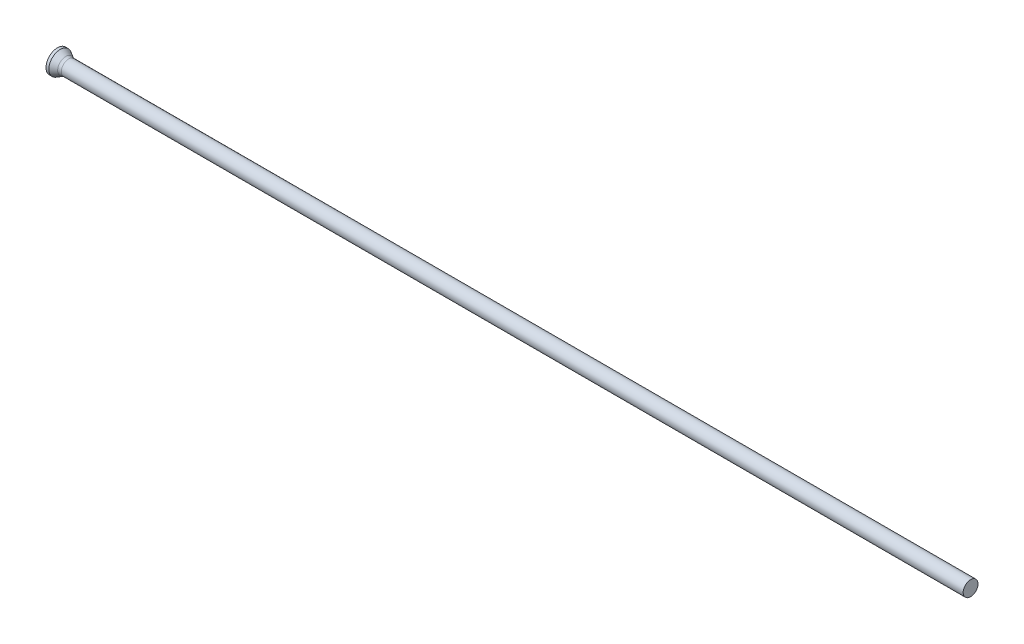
ISO-10303-21;
HEADER;
FILE_DESCRIPTION(('STEP AP214'),'2;1');
FILE_NAME('part.step','',(''),(''),'','','');
FILE_SCHEMA(('AUTOMOTIVE_DESIGN { 1 0 10303 214 1 1 1 1 }'));
ENDSEC;
DATA;
#1=APPLICATION_CONTEXT('core data for automotive mechanical design processes');
#2=APPLICATION_PROTOCOL_DEFINITION('international standard','automotive_design',2000,#1);
#3=PRODUCT_CONTEXT('',#1,'mechanical');
#4=PRODUCT('Part','Part','',(#3));
#5=PRODUCT_RELATED_PRODUCT_CATEGORY('part','',(#4));
#6=PRODUCT_DEFINITION_FORMATION('','',#4);
#7=PRODUCT_DEFINITION_CONTEXT('part definition',#1,'design');
#8=PRODUCT_DEFINITION('design','',#6,#7);
#9=PRODUCT_DEFINITION_SHAPE('','',#8);
#10=(LENGTH_UNIT() NAMED_UNIT(*) SI_UNIT(.MILLI.,.METRE.));
#11=(NAMED_UNIT(*) PLANE_ANGLE_UNIT() SI_UNIT($,.RADIAN.));
#12=(NAMED_UNIT(*) SI_UNIT($,.STERADIAN.) SOLID_ANGLE_UNIT());
#13=UNCERTAINTY_MEASURE_WITH_UNIT(LENGTH_MEASURE(1.E-05),#10,'distance_accuracy_value','');
#14=(GEOMETRIC_REPRESENTATION_CONTEXT(3) GLOBAL_UNCERTAINTY_ASSIGNED_CONTEXT((#13)) GLOBAL_UNIT_ASSIGNED_CONTEXT((#10,
#11,#12)) REPRESENTATION_CONTEXT('',''));
#15=CARTESIAN_POINT('',(0.,0.,0.));
#16=DIRECTION('',(0.,0.,1.));
#17=DIRECTION('',(1.,0.,0.));
#18=AXIS2_PLACEMENT_3D('',#15,#16,#17);
#19=CARTESIAN_POINT('',(0.,0.,0.));
#20=DIRECTION('',(1.,0.,0.));
#21=DIRECTION('',(0.,0.,-1.));
#22=AXIS2_PLACEMENT_3D('',#19,#20,#21);
#23=PLANE('',#22);
#24=CARTESIAN_POINT('',(0.,0.,0.));
#25=DIRECTION('',(-1.,0.,0.));
#26=DIRECTION('',(0.,0.,1.));
#27=AXIS2_PLACEMENT_3D('',#24,#25,#26);
#28=CIRCLE('',#27,2.);
#29=CARTESIAN_POINT('',(0.,0.,2.));
#30=VERTEX_POINT('',#29);
#31=EDGE_CURVE('E29',#30,#30,#28,.T.);
#32=ORIENTED_EDGE('',*,*,#31,.T.);
#33=EDGE_LOOP('',(#32));
#34=FACE_BOUND('',#33,.T.);
#35=ADVANCED_FACE('F14',(#34),#23,.F.);
#36=CARTESIAN_POINT('',(0.,0.,0.));
#37=DIRECTION('',(-1.,0.,0.));
#38=DIRECTION('',(0.,0.,1.));
#39=AXIS2_PLACEMENT_3D('',#36,#37,#38);
#40=CYLINDRICAL_SURFACE('',#39,2.);
#41=ORIENTED_EDGE('',*,*,#31,.F.);
#42=EDGE_LOOP('',(#41));
#43=FACE_BOUND('',#42,.T.);
#44=CARTESIAN_POINT('',(0.497564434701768,0.,0.));
#45=DIRECTION('',(-1.,0.,0.));
#46=DIRECTION('',(0.,0.,1.));
#47=AXIS2_PLACEMENT_3D('',#44,#45,#46);
#48=CIRCLE('',#47,2.);
#49=CARTESIAN_POINT('',(0.497564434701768,0.,2.));
#50=VERTEX_POINT('',#49);
#51=EDGE_CURVE('E35',#50,#50,#48,.T.);
#52=ORIENTED_EDGE('',*,*,#51,.T.);
#53=EDGE_LOOP('',(#52));
#54=FACE_BOUND('',#53,.T.);
#55=ADVANCED_FACE('F57',(#43,#54),#40,.T.);
#56=CARTESIAN_POINT('',(1.71,0.,0.));
#57=DIRECTION('',(-1.,0.,0.));
#58=DIRECTION('',(0.,0.,1.));
#59=AXIS2_PLACEMENT_3D('',#56,#57,#58);
#60=CONICAL_SURFACE('',#59,1.3,0.523598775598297);
#61=CARTESIAN_POINT('',(1.47794919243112,0.,0.));
#62=DIRECTION('',(-1.,0.,0.));
#63=DIRECTION('',(0.,0.,1.));
#64=AXIS2_PLACEMENT_3D('',#61,#62,#63);
#65=CIRCLE('',#64,1.43397459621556);
#66=CARTESIAN_POINT('',(1.47794919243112,0.,1.43397459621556));
#67=VERTEX_POINT('',#66);
#68=EDGE_CURVE('E22',#67,#67,#65,.T.);
#69=ORIENTED_EDGE('',*,*,#68,.T.);
#70=EDGE_LOOP('',(#69));
#71=FACE_BOUND('',#70,.T.);
#72=ORIENTED_EDGE('',*,*,#51,.F.);
#73=EDGE_LOOP('',(#72));
#74=FACE_BOUND('',#73,.T.);
#75=ADVANCED_FACE('F54',(#71,#74),#60,.T.);
#76=CARTESIAN_POINT('',(0.,0.,0.));
#77=DIRECTION('',(-1.,0.,0.));
#78=DIRECTION('',(0.,0.,1.));
#79=AXIS2_PLACEMENT_3D('',#76,#77,#78);
#80=CYLINDRICAL_SURFACE('',#79,1.3);
#81=CARTESIAN_POINT('',(1.97794919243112,0.,0.));
#82=DIRECTION('',(-1.,0.,0.));
#83=DIRECTION('',(0.,0.,1.));
#84=AXIS2_PLACEMENT_3D('',#81,#82,#83);
#85=CIRCLE('',#84,1.3);
#86=CARTESIAN_POINT('',(1.97794919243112,0.,1.3));
#87=VERTEX_POINT('',#86);
#88=EDGE_CURVE('E9',#87,#87,#85,.F.);
#89=ORIENTED_EDGE('',*,*,#88,.T.);
#90=EDGE_LOOP('',(#89));
#91=FACE_BOUND('',#90,.T.);
#92=CARTESIAN_POINT('',(160.,0.,0.));
#93=DIRECTION('',(-1.,0.,0.));
#94=DIRECTION('',(0.,0.,1.));
#95=AXIS2_PLACEMENT_3D('',#92,#93,#94);
#96=CIRCLE('',#95,1.3);
#97=CARTESIAN_POINT('',(160.,0.,1.3));
#98=VERTEX_POINT('',#97);
#99=EDGE_CURVE('E40',#98,#98,#96,.T.);
#100=ORIENTED_EDGE('',*,*,#99,.T.);
#101=EDGE_LOOP('',(#100));
#102=FACE_BOUND('',#101,.T.);
#103=ADVANCED_FACE('F44',(#91,#102),#80,.T.);
#104=CARTESIAN_POINT('',(160.,1.3,0.));
#105=DIRECTION('',(-1.,0.,0.));
#106=DIRECTION('',(0.,0.,1.));
#107=AXIS2_PLACEMENT_3D('',#104,#105,#106);
#108=PLANE('',#107);
#109=ORIENTED_EDGE('',*,*,#99,.F.);
#110=EDGE_LOOP('',(#109));
#111=FACE_BOUND('',#110,.T.);
#112=ADVANCED_FACE('F46',(#111),#108,.F.);
#113=CARTESIAN_POINT('',(1.97794919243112,0.,0.));
#114=DIRECTION('',(-1.,0.,0.));
#115=DIRECTION('',(0.,0.,1.));
#116=AXIS2_PLACEMENT_3D('',#113,#114,#115);
#117=TOROIDAL_SURFACE('',#116,2.3,1.);
#118=ORIENTED_EDGE('',*,*,#88,.F.);
#119=EDGE_LOOP('',(#118));
#120=FACE_BOUND('',#119,.T.);
#121=ORIENTED_EDGE('',*,*,#68,.F.);
#122=EDGE_LOOP('',(#121));
#123=FACE_BOUND('',#122,.T.);
#124=ADVANCED_FACE('F16',(#120,#123),#117,.F.);
#125=CLOSED_SHELL('',(#35,#55,#75,#103,#112,#124));
#126=MANIFOLD_SOLID_BREP('B1',#125);
#127=ADVANCED_BREP_SHAPE_REPRESENTATION('',(#18,#126),#14);
#128=SHAPE_DEFINITION_REPRESENTATION(#9,#127);
ENDSEC;
END-ISO-10303-21;
